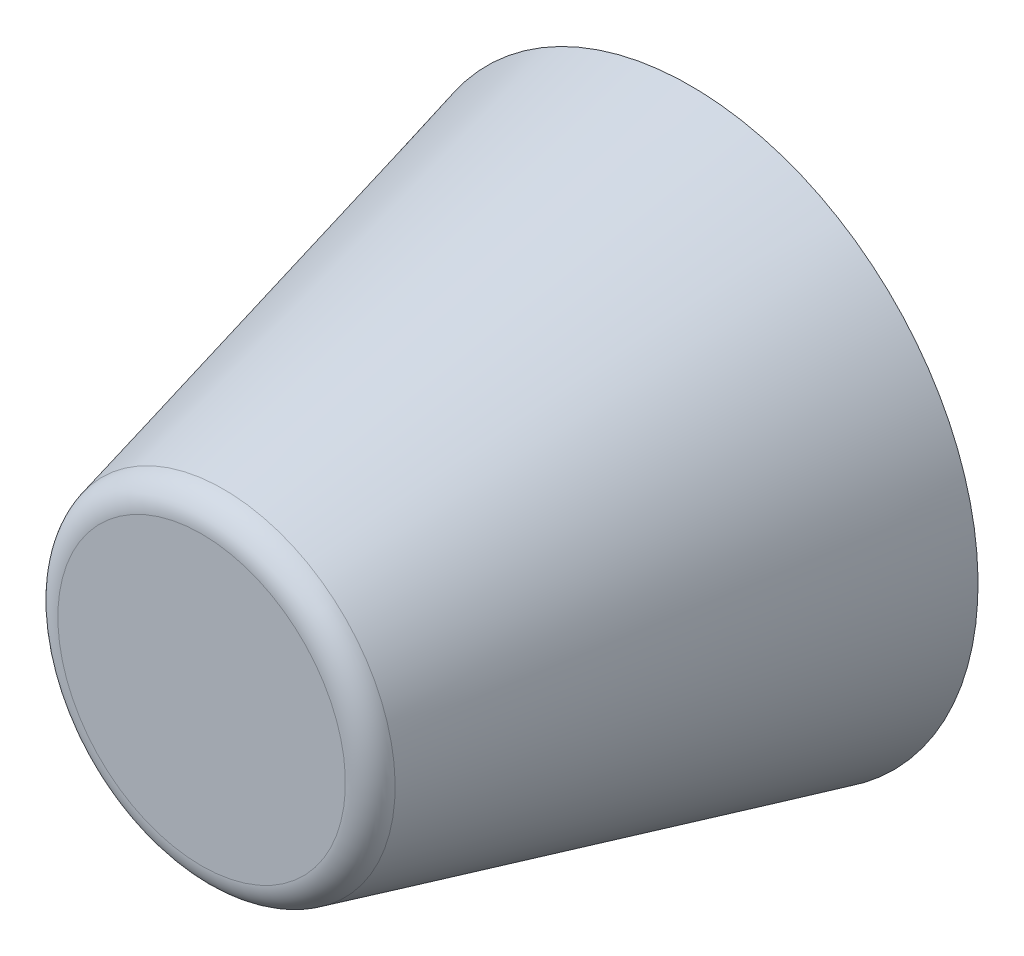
ISO-10303-21;
HEADER;
FILE_DESCRIPTION(('STEP AP214'),'2;1');
FILE_NAME('part.step','',(''),(''),'','','');
FILE_SCHEMA(('AUTOMOTIVE_DESIGN { 1 0 10303 214 1 1 1 1 }'));
ENDSEC;
DATA;
#1=APPLICATION_CONTEXT('core data for automotive mechanical design processes');
#2=APPLICATION_PROTOCOL_DEFINITION('international standard','automotive_design',2000,#1);
#3=PRODUCT_CONTEXT('',#1,'mechanical');
#4=PRODUCT('Part','Part','',(#3));
#5=PRODUCT_RELATED_PRODUCT_CATEGORY('part','',(#4));
#6=PRODUCT_DEFINITION_FORMATION('','',#4);
#7=PRODUCT_DEFINITION_CONTEXT('part definition',#1,'design');
#8=PRODUCT_DEFINITION('design','',#6,#7);
#9=PRODUCT_DEFINITION_SHAPE('','',#8);
#10=(LENGTH_UNIT() NAMED_UNIT(*) SI_UNIT(.MILLI.,.METRE.));
#11=(NAMED_UNIT(*) PLANE_ANGLE_UNIT() SI_UNIT($,.RADIAN.));
#12=(NAMED_UNIT(*) SI_UNIT($,.STERADIAN.) SOLID_ANGLE_UNIT());
#13=UNCERTAINTY_MEASURE_WITH_UNIT(LENGTH_MEASURE(1.E-05),#10,'distance_accuracy_value','');
#14=(GEOMETRIC_REPRESENTATION_CONTEXT(3) GLOBAL_UNCERTAINTY_ASSIGNED_CONTEXT((#13)) GLOBAL_UNIT_ASSIGNED_CONTEXT((#10,
#11,#12)) REPRESENTATION_CONTEXT('',''));
#15=CARTESIAN_POINT('',(0.,0.,0.));
#16=DIRECTION('',(0.,0.,1.));
#17=DIRECTION('',(1.,0.,0.));
#18=AXIS2_PLACEMENT_3D('',#15,#16,#17);
#19=CARTESIAN_POINT('',(0.,0.,17.));
#20=DIRECTION('',(0.,0.,1.));
#21=DIRECTION('',(0.,-1.,0.));
#22=AXIS2_PLACEMENT_3D('',#19,#20,#21);
#23=CYLINDRICAL_SURFACE('',#22,9.);
#24=CARTESIAN_POINT('',(0.,0.,0.));
#25=DIRECTION('',(0.,0.,1.));
#26=DIRECTION('',(0.,-1.,0.));
#27=AXIS2_PLACEMENT_3D('',#24,#25,#26);
#28=CIRCLE('',#27,9.);
#29=CARTESIAN_POINT('',(0.,-9.,0.));
#30=VERTEX_POINT('',#29);
#31=EDGE_CURVE('E8',#30,#30,#28,.T.);
#32=ORIENTED_EDGE('',*,*,#31,.F.);
#33=EDGE_LOOP('',(#32));
#34=FACE_BOUND('',#33,.T.);
#35=CARTESIAN_POINT('',(0.,0.,0.0500000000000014));
#36=DIRECTION('',(0.,0.,1.));
#37=DIRECTION('',(0.,-1.,0.));
#38=AXIS2_PLACEMENT_3D('',#35,#36,#37);
#39=CIRCLE('',#38,9.);
#40=CARTESIAN_POINT('',(0.,-9.,0.0500000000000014));
#41=VERTEX_POINT('',#40);
#42=EDGE_CURVE('E34',#41,#41,#39,.T.);
#43=ORIENTED_EDGE('',*,*,#42,.T.);
#44=EDGE_LOOP('',(#43));
#45=FACE_BOUND('',#44,.T.);
#46=ADVANCED_FACE('F12',(#34,#45),#23,.F.);
#47=CARTESIAN_POINT('',(9.,0.,0.));
#48=DIRECTION('',(0.,0.,1.));
#49=DIRECTION('',(0.,-1.,0.));
#50=AXIS2_PLACEMENT_3D('',#47,#48,#49);
#51=PLANE('',#50);
#52=CARTESIAN_POINT('',(0.,0.,0.));
#53=DIRECTION('',(0.,0.,1.));
#54=DIRECTION('',(0.,-1.,0.));
#55=AXIS2_PLACEMENT_3D('',#52,#53,#54);
#56=CIRCLE('',#55,10.);
#57=CARTESIAN_POINT('',(0.,-10.,0.));
#58=VERTEX_POINT('',#57);
#59=EDGE_CURVE('E18',#58,#58,#56,.T.);
#60=ORIENTED_EDGE('',*,*,#59,.F.);
#61=EDGE_LOOP('',(#60));
#62=FACE_BOUND('',#61,.T.);
#63=ORIENTED_EDGE('',*,*,#31,.T.);
#64=EDGE_LOOP('',(#63));
#65=FACE_BOUND('',#64,.T.);
#66=ADVANCED_FACE('F70',(#62,#65),#51,.F.);
#67=CARTESIAN_POINT('',(0.,0.,0.));
#68=DIRECTION('',(0.,0.,-1.));
#69=DIRECTION('',(0.,1.,0.));
#70=AXIS2_PLACEMENT_3D('',#67,#68,#69);
#71=CONICAL_SURFACE('',#70,10.,0.243194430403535);
#72=CARTESIAN_POINT('',(0.,0.,16.2408042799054));
#73=DIRECTION('',(0.,0.,1.));
#74=DIRECTION('',(0.,-1.,0.));
#75=AXIS2_PLACEMENT_3D('',#72,#73,#74);
#76=CIRCLE('',#75,5.97057369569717);
#77=CARTESIAN_POINT('',(0.,-5.97057369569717,16.2408042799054));
#78=VERTEX_POINT('',#77);
#79=EDGE_CURVE('E22',#78,#78,#76,.T.);
#80=ORIENTED_EDGE('',*,*,#79,.F.);
#81=EDGE_LOOP('',(#80));
#82=FACE_BOUND('',#81,.T.);
#83=ORIENTED_EDGE('',*,*,#59,.T.);
#84=EDGE_LOOP('',(#83));
#85=FACE_BOUND('',#84,.T.);
#86=ADVANCED_FACE('F75',(#82,#85),#71,.T.);
#87=CARTESIAN_POINT('',(0.,0.,16.));
#88=DIRECTION('',(0.,0.,1.));
#89=DIRECTION('',(0.,-1.,0.));
#90=AXIS2_PLACEMENT_3D('',#87,#88,#89);
#91=TOROIDAL_SURFACE('',#90,5.,1.);
#92=ORIENTED_EDGE('',*,*,#79,.T.);
#93=EDGE_LOOP('',(#92));
#94=FACE_BOUND('',#93,.T.);
#95=CARTESIAN_POINT('',(0.,0.,17.));
#96=DIRECTION('',(0.,0.,1.));
#97=DIRECTION('',(0.,-1.,0.));
#98=AXIS2_PLACEMENT_3D('',#95,#96,#97);
#99=CIRCLE('',#98,5.);
#100=CARTESIAN_POINT('',(0.,-5.,17.));
#101=VERTEX_POINT('',#100);
#102=EDGE_CURVE('E26',#101,#101,#99,.T.);
#103=ORIENTED_EDGE('',*,*,#102,.F.);
#104=EDGE_LOOP('',(#103));
#105=FACE_BOUND('',#104,.T.);
#106=ADVANCED_FACE('F65',(#94,#105),#91,.T.);
#107=CARTESIAN_POINT('',(5.,0.,17.));
#108=DIRECTION('',(0.,0.,-1.));
#109=DIRECTION('',(0.,1.,0.));
#110=AXIS2_PLACEMENT_3D('',#107,#108,#109);
#111=PLANE('',#110);
#112=ORIENTED_EDGE('',*,*,#102,.T.);
#113=EDGE_LOOP('',(#112));
#114=FACE_BOUND('',#113,.T.);
#115=ADVANCED_FACE('F55',(#114),#111,.F.);
#116=CARTESIAN_POINT('',(0.,0.,0.));
#117=DIRECTION('',(0.,0.,1.));
#118=DIRECTION('',(0.,-1.,0.));
#119=AXIS2_PLACEMENT_3D('',#116,#117,#118);
#120=PLANE('',#119);
#121=CARTESIAN_POINT('',(0.,0.,0.));
#122=DIRECTION('',(0.,0.,1.));
#123=DIRECTION('',(0.,-1.,0.));
#124=AXIS2_PLACEMENT_3D('',#121,#122,#123);
#125=CIRCLE('',#124,8.95);
#126=CARTESIAN_POINT('',(0.,-8.95,0.));
#127=VERTEX_POINT('',#126);
#128=EDGE_CURVE('E31',#127,#127,#125,.T.);
#129=ORIENTED_EDGE('',*,*,#128,.F.);
#130=EDGE_LOOP('',(#129));
#131=FACE_BOUND('',#130,.T.);
#132=CARTESIAN_POINT('',(0.,0.,0.));
#133=DIRECTION('',(0.,0.,-1.));
#134=DIRECTION('',(0.,1.,0.));
#135=AXIS2_PLACEMENT_3D('',#132,#133,#134);
#136=CIRCLE('',#135,2.5);
#137=CARTESIAN_POINT('',(0.,2.5,0.));
#138=VERTEX_POINT('',#137);
#139=EDGE_CURVE('E38',#138,#138,#136,.T.);
#140=ORIENTED_EDGE('',*,*,#139,.F.);
#141=EDGE_LOOP('',(#140));
#142=FACE_BOUND('',#141,.T.);
#143=ADVANCED_FACE('F53',(#131,#142),#120,.F.);
#144=CARTESIAN_POINT('',(0.,0.,0.));
#145=DIRECTION('',(0.,0.,1.));
#146=DIRECTION('',(0.,-1.,0.));
#147=AXIS2_PLACEMENT_3D('',#144,#145,#146);
#148=CONICAL_SURFACE('',#147,8.95,0.785398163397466);
#149=ORIENTED_EDGE('',*,*,#42,.F.);
#150=EDGE_LOOP('',(#149));
#151=FACE_BOUND('',#150,.T.);
#152=ORIENTED_EDGE('',*,*,#128,.T.);
#153=EDGE_LOOP('',(#152));
#154=FACE_BOUND('',#153,.T.);
#155=ADVANCED_FACE('F49',(#151,#154),#148,.T.);
#156=CARTESIAN_POINT('',(0.,0.,5.));
#157=DIRECTION('',(0.,0.,-1.));
#158=DIRECTION('',(0.,1.,0.));
#159=AXIS2_PLACEMENT_3D('',#156,#157,#158);
#160=CYLINDRICAL_SURFACE('',#159,2.5);
#161=CARTESIAN_POINT('',(0.,0.,5.));
#162=DIRECTION('',(0.,0.,-1.));
#163=DIRECTION('',(0.,1.,0.));
#164=AXIS2_PLACEMENT_3D('',#161,#162,#163);
#165=CIRCLE('',#164,2.5);
#166=CARTESIAN_POINT('',(0.,2.5,5.));
#167=VERTEX_POINT('',#166);
#168=EDGE_CURVE('E37',#167,#167,#165,.T.);
#169=ORIENTED_EDGE('',*,*,#168,.F.);
#170=EDGE_LOOP('',(#169));
#171=FACE_BOUND('',#170,.T.);
#172=ORIENTED_EDGE('',*,*,#139,.T.);
#173=EDGE_LOOP('',(#172));
#174=FACE_BOUND('',#173,.T.);
#175=ADVANCED_FACE('F46',(#171,#174),#160,.F.);
#176=CARTESIAN_POINT('',(0.,0.,5.));
#177=DIRECTION('',(0.,0.,-1.));
#178=DIRECTION('',(0.,1.,0.));
#179=AXIS2_PLACEMENT_3D('',#176,#177,#178);
#180=PLANE('',#179);
#181=ORIENTED_EDGE('',*,*,#168,.T.);
#182=EDGE_LOOP('',(#181));
#183=FACE_BOUND('',#182,.T.);
#184=ADVANCED_FACE('F44',(#183),#180,.T.);
#185=CLOSED_SHELL('',(#46,#66,#86,#106,#115,#143,#155,#175,#184));
#186=MANIFOLD_SOLID_BREP('B1',#185);
#187=ADVANCED_BREP_SHAPE_REPRESENTATION('',(#18,#186),#14);
#188=SHAPE_DEFINITION_REPRESENTATION(#9,#187);
ENDSEC;
END-ISO-10303-21;
